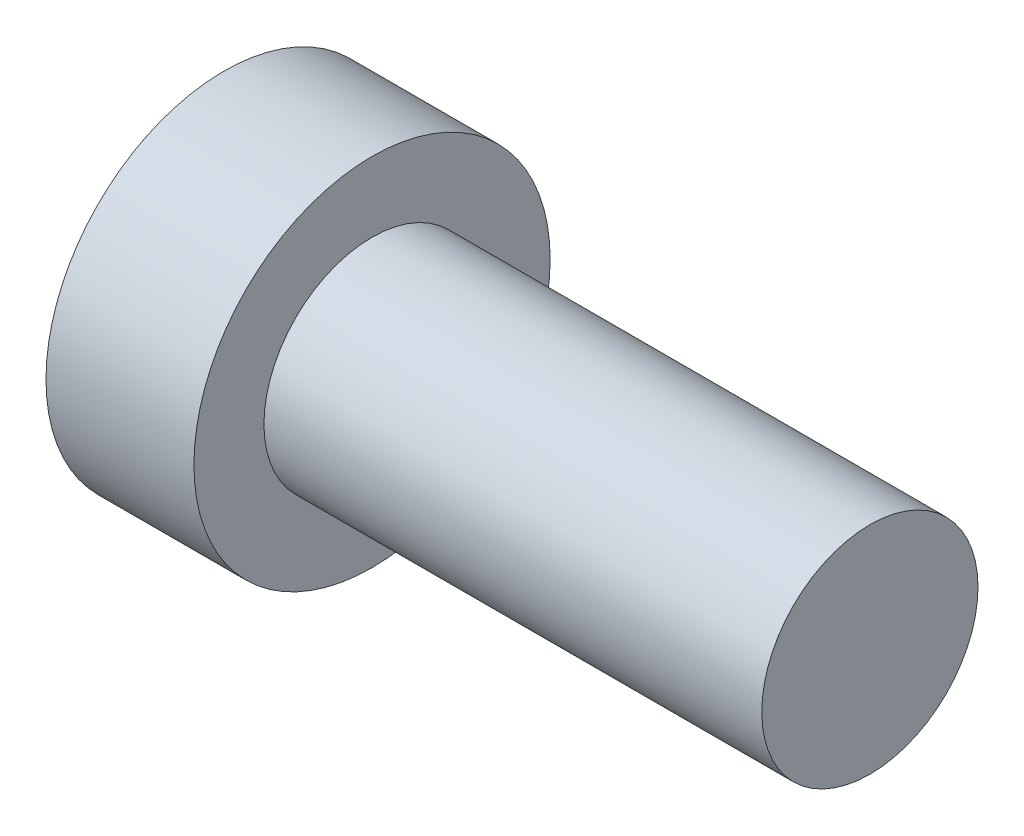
from build123d import *

# Parameters (mm, degrees)
CIRPATTERN1_COUNT = 2
CIRPATTERN1_ANGLE = 90


with BuildPart() as part:
    # BodySke → Base-Revolve (revolve)
    with BuildSketch(Plane.XY, mode=Mode.PRIVATE) as base_revolve_sk:
        with BuildLine():
            Line((4.572, 2.413), (4.572, 3.9751))
            Line((4.572, 3.9751), (1.27, 3.9751))
            ThreePointArc((1.27, 3.9751), (0.32521318, 2.086523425), (0, 0))
            Line((0, 0), (15.6845, 0))
            Line((15.6845, 0), (15.6845, 2.413))
            Line((15.6845, 2.413), (4.572, 2.413))
        make_face()
    revolve(base_revolve_sk.sketch.rotate(Axis((-25.4, 0, 0), (1, 0, 0)), 90), axis=Axis((-25.4, 0, 0), (1, 0, 0)))

    # Sketch3 → Cross section 0
    with BuildSketch(Plane(origin=(0, 0, 0), x_dir=(0, 0, -1), z_dir=(1, 0, 0))):
        with BuildLine():
            Line((0.5461, -2.9845), (-0.5461, -2.9845))
            Line((-0.5461, -2.9845), (-0.5461, 2.9845))
            Line((-0.5461, 2.9845), (0.5461, 2.9845))
            Line((0.5461, 2.9845), (0.5461, -2.9845))
        make_face()
    # Sketch4 → Cross section 1
    with BuildSketch(Plane(origin=(3.4036, 0, 0), x_dir=(0, 0, -1), z_dir=(1, 0, 0))):
        with BuildLine():
            Line((0.27305, -0.27305), (-0.27305, -0.27305))
            Line((-0.27305, -0.27305), (-0.27305, 0.27305))
            Line((-0.27305, 0.27305), (0.27305, 0.27305))
            Line((0.27305, 0.27305), (0.27305, -0.27305))
        make_face()
    cross = loft(mode=Mode.SUBTRACT)

    # CirPattern1: Cross ×2 about axis
    cirpattern1_axis = Axis((0, 0, 0), (1, 0, 0))
    for i in range(1, CIRPATTERN1_COUNT):
        add(cross.rotate(cirpattern1_axis, i * CIRPATTERN1_ANGLE / (CIRPATTERN1_COUNT - 1)), mode=Mode.SUBTRACT)


solid = part.part
